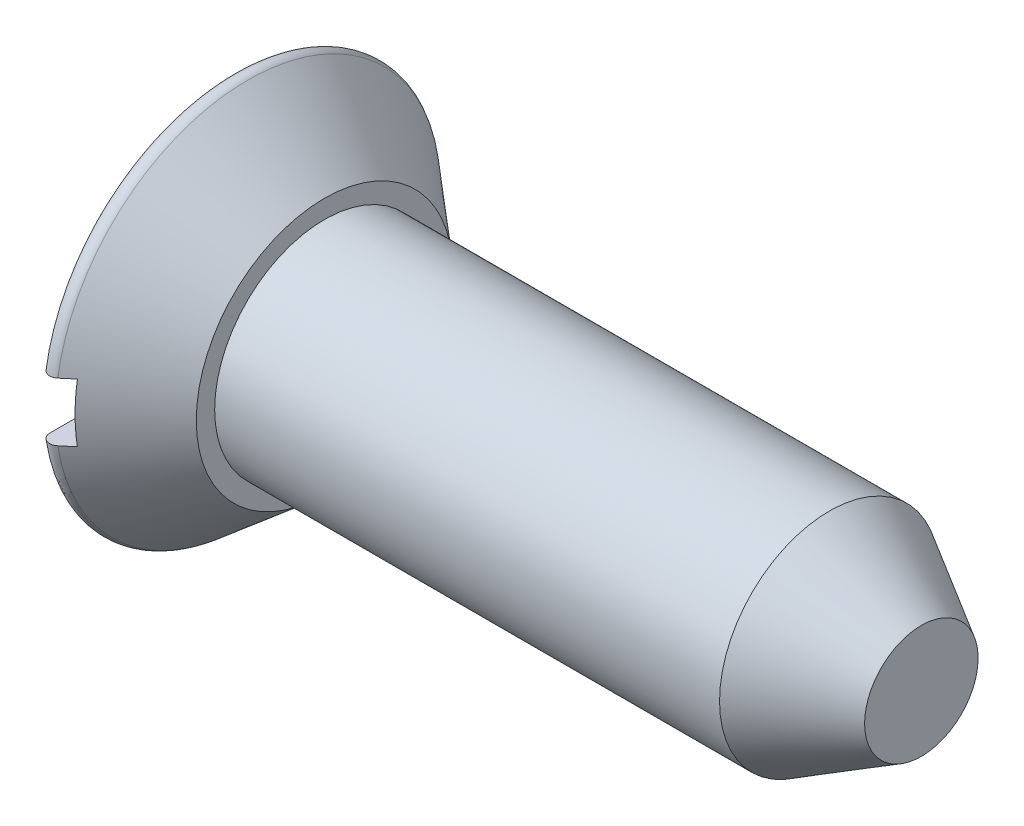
ISO-10303-21;
HEADER;
FILE_DESCRIPTION(('STEP AP214'),'2;1');
FILE_NAME('part.step','',(''),(''),'','','');
FILE_SCHEMA(('AUTOMOTIVE_DESIGN { 1 0 10303 214 1 1 1 1 }'));
ENDSEC;
DATA;
#1=APPLICATION_CONTEXT('core data for automotive mechanical design processes');
#2=APPLICATION_PROTOCOL_DEFINITION('international standard','automotive_design',2000,#1);
#3=PRODUCT_CONTEXT('',#1,'mechanical');
#4=PRODUCT('Part','Part','',(#3));
#5=PRODUCT_RELATED_PRODUCT_CATEGORY('part','',(#4));
#6=PRODUCT_DEFINITION_FORMATION('','',#4);
#7=PRODUCT_DEFINITION_CONTEXT('part definition',#1,'design');
#8=PRODUCT_DEFINITION('design','',#6,#7);
#9=PRODUCT_DEFINITION_SHAPE('','',#8);
#10=(LENGTH_UNIT() NAMED_UNIT(*) SI_UNIT(.MILLI.,.METRE.));
#11=(NAMED_UNIT(*) PLANE_ANGLE_UNIT() SI_UNIT($,.RADIAN.));
#12=(NAMED_UNIT(*) SI_UNIT($,.STERADIAN.) SOLID_ANGLE_UNIT());
#13=UNCERTAINTY_MEASURE_WITH_UNIT(LENGTH_MEASURE(1.E-05),#10,'distance_accuracy_value','');
#14=(GEOMETRIC_REPRESENTATION_CONTEXT(3) GLOBAL_UNCERTAINTY_ASSIGNED_CONTEXT((#13)) GLOBAL_UNIT_ASSIGNED_CONTEXT((#10,
#11,#12)) REPRESENTATION_CONTEXT('',''));
#15=CARTESIAN_POINT('',(0.,0.,0.));
#16=DIRECTION('',(0.,0.,1.));
#17=DIRECTION('',(1.,0.,0.));
#18=AXIS2_PLACEMENT_3D('',#15,#16,#17);
#19=CARTESIAN_POINT('',(0.,0.,0.));
#20=DIRECTION('',(-1.,0.,0.));
#21=DIRECTION('',(0.,0.,1.));
#22=AXIS2_PLACEMENT_3D('',#19,#20,#21);
#23=CYLINDRICAL_SURFACE('',#22,0.762);
#24=CARTESIAN_POINT('',(0.635,0.,0.));
#25=DIRECTION('',(-1.,0.,0.));
#26=DIRECTION('',(0.,0.,1.));
#27=AXIS2_PLACEMENT_3D('',#24,#25,#26);
#28=CIRCLE('',#27,0.762);
#29=CARTESIAN_POINT('',(0.635,0.,0.762));
#30=VERTEX_POINT('',#29);
#31=EDGE_CURVE('E198',#30,#30,#28,.T.);
#32=ORIENTED_EDGE('',*,*,#31,.F.);
#33=EDGE_LOOP('',(#32));
#34=FACE_BOUND('',#33,.T.);
#35=CARTESIAN_POINT('',(4.13728568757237,0.,0.));
#36=DIRECTION('',(-1.,0.,0.));
#37=DIRECTION('',(0.,0.,1.));
#38=AXIS2_PLACEMENT_3D('',#35,#36,#37);
#39=CIRCLE('',#38,0.762);
#40=CARTESIAN_POINT('',(4.13728568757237,0.,0.762));
#41=VERTEX_POINT('',#40);
#42=EDGE_CURVE('E261',#41,#41,#39,.T.);
#43=ORIENTED_EDGE('',*,*,#42,.T.);
#44=EDGE_LOOP('',(#43));
#45=FACE_BOUND('',#44,.T.);
#46=ADVANCED_FACE('F82',(#34,#45),#23,.T.);
#47=CARTESIAN_POINT('',(0.,0.,0.));
#48=DIRECTION('',(1.,0.,0.));
#49=DIRECTION('',(0.,0.,-1.));
#50=AXIS2_PLACEMENT_3D('',#47,#48,#49);
#51=PLANE('',#50);
#52=CARTESIAN_POINT('',(0.,0.,0.));
#53=DIRECTION('',(-1.,0.,0.));
#54=DIRECTION('',(0.,0.,1.));
#55=AXIS2_PLACEMENT_3D('',#52,#53,#54);
#56=CIRCLE('',#55,1.28622381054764);
#57=CARTESIAN_POINT('',(0.,0.2032,1.27007143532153));
#58=VERTEX_POINT('',#57);
#59=CARTESIAN_POINT('',(0.,0.2032,-1.27007143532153));
#60=VERTEX_POINT('',#59);
#61=EDGE_CURVE('E180',#58,#60,#56,.T.);
#62=ORIENTED_EDGE('',*,*,#61,.T.);
#63=DIRECTION('',(0.,0.,1.));
#64=VECTOR('',#63,1.);
#65=CARTESIAN_POINT('',(0.,0.2032,-1.34972381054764));
#66=LINE('',#65,#64);
#67=EDGE_CURVE('E237',#60,#58,#66,.T.);
#68=ORIENTED_EDGE('',*,*,#67,.T.);
#69=EDGE_LOOP('',(#62,#68));
#70=FACE_BOUND('',#69,.T.);
#71=ADVANCED_FACE('F276',(#70),#51,.F.);
#72=CARTESIAN_POINT('',(0.0635,0.,0.));
#73=DIRECTION('',(-1.,0.,0.));
#74=DIRECTION('',(0.,0.,1.));
#75=AXIS2_PLACEMENT_3D('',#72,#73,#74);
#76=TOROIDAL_SURFACE('',#75,1.28622381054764,0.0634999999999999);
#77=CARTESIAN_POINT('',(0.104317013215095,0.,0.));
#78=DIRECTION('',(-1.,0.,0.));
#79=DIRECTION('',(0.,0.,1.));
#80=AXIS2_PLACEMENT_3D('',#77,#78,#79);
#81=CIRCLE('',#80,1.3348676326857);
#82=CARTESIAN_POINT('',(0.104317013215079,0.2032,1.31931094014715));
#83=VERTEX_POINT('',#82);
#84=CARTESIAN_POINT('',(0.104317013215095,0.2032,-1.31931094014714));
#85=VERTEX_POINT('',#84);
#86=EDGE_CURVE('E191',#83,#85,#81,.T.);
#87=ORIENTED_EDGE('',*,*,#86,.T.);
#88=CARTESIAN_POINT('',(0.0245970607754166,0.2032,-1.32087306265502));
#89=CARTESIAN_POINT('',(0.0217621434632,0.2032,-1.3186495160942));
#90=CARTESIAN_POINT('',(0.0191144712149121,0.2032,-1.31618267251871));
#91=CARTESIAN_POINT('',(0.0142700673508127,0.2032,-1.31083617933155));
#92=CARTESIAN_POINT('',(0.0120739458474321,0.2032,-1.30795598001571));
#93=CARTESIAN_POINT('',(0.00819684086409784,0.2032,-1.30187126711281));
#94=CARTESIAN_POINT('',(0.00651536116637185,0.2032,-1.29866706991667));
#95=CARTESIAN_POINT('',(0.00370972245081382,0.2032,-1.29202456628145));
#96=CARTESIAN_POINT('',(0.00258542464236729,0.2032,-1.28858631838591));
#97=CARTESIAN_POINT('',(0.000915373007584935,0.2032,-1.28154210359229));
#98=CARTESIAN_POINT('',(0.000374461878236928,0.2032,-1.27793498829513));
#99=CARTESIAN_POINT('',(-9.85513835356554E-05,0.2032,-1.27068084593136));
#100=CARTESIAN_POINT('',(-3.05991733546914E-05,0.2032,-1.26703381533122));
#101=CARTESIAN_POINT('',(0.000714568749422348,0.2032,-1.25977791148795));
#102=CARTESIAN_POINT('',(0.00139583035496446,0.2032,-1.25616945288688));
#103=CARTESIAN_POINT('',(0.00335504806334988,0.2032,-1.24911821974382));
#104=CARTESIAN_POINT('',(0.0046330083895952,0.2032,-1.24567544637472));
#105=CARTESIAN_POINT('',(0.00774975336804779,0.2032,-1.23905821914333));
#106=CARTESIAN_POINT('',(0.00958793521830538,0.2032,-1.23588348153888));
#107=CARTESIAN_POINT('',(0.0137757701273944,0.2032,-1.2298913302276));
#108=CARTESIAN_POINT('',(0.0161254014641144,0.2032,-1.22707390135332));
#109=CARTESIAN_POINT('',(0.021247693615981,0.2032,-1.22190446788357));
#110=CARTESIAN_POINT('',(0.0240163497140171,0.2032,-1.21954849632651));
#111=CARTESIAN_POINT('',(0.0299143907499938,0.2032,-1.21534225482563));
#112=CARTESIAN_POINT('',(0.0330437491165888,0.2032,-1.21349194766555));
#113=CARTESIAN_POINT('',(0.0395299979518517,0.2032,-1.21037547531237));
#114=CARTESIAN_POINT('',(0.0428833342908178,0.2032,-1.20910191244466));
#115=CARTESIAN_POINT('',(0.0497576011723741,0.2032,-1.20714299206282));
#116=CARTESIAN_POINT('',(0.053278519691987,0.2032,-1.20645759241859));
#117=CARTESIAN_POINT('',(0.0603461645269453,0.2032,-1.20570077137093));
#118=CARTESIAN_POINT('',(0.0638921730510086,0.2032,-1.20562263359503));
#119=CARTESIAN_POINT('',(0.0709465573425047,0.2032,-1.20606504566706));
#120=CARTESIAN_POINT('',(0.0744549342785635,0.2032,-1.20658557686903));
#121=CARTESIAN_POINT('',(0.081322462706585,0.2032,-1.20820641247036));
#122=CARTESIAN_POINT('',(0.0846820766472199,0.2032,-1.20930475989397));
#123=CARTESIAN_POINT('',(0.0911708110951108,0.2032,-1.21204664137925));
#124=CARTESIAN_POINT('',(0.0942999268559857,0.2032,-1.21369018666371));
#125=CARTESIAN_POINT('',(0.100259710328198,0.2032,-1.21748487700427));
#126=CARTESIAN_POINT('',(0.103088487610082,0.2032,-1.21963898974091));
#127=CARTESIAN_POINT('',(0.108349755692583,0.2032,-1.2243862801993));
#128=CARTESIAN_POINT('',(0.110782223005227,0.2032,-1.22697948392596));
#129=CARTESIAN_POINT('',(0.115213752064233,0.2032,-1.23256496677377));
#130=CARTESIAN_POINT('',(0.117207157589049,0.2032,-1.23556173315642));
#131=CARTESIAN_POINT('',(0.120669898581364,0.2032,-1.24184409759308));
#132=CARTESIAN_POINT('',(0.12213919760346,0.2032,-1.24512971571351));
#133=CARTESIAN_POINT('',(0.124530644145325,0.2032,-1.2519409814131));
#134=CARTESIAN_POINT('',(0.125445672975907,0.2032,-1.25546912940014));
#135=CARTESIAN_POINT('',(0.126675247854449,0.2032,-1.26262860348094));
#136=CARTESIAN_POINT('',(0.126989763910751,0.2032,-1.26625993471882));
#137=CARTESIAN_POINT('',(0.127009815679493,0.2032,-1.27355096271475));
#138=CARTESIAN_POINT('',(0.126710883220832,0.2032,-1.27721067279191));
#139=CARTESIAN_POINT('',(0.125502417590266,0.2032,-1.28442794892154));
#140=CARTESIAN_POINT('',(0.124592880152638,0.2032,-1.28798551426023));
#141=CARTESIAN_POINT('',(0.122188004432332,0.2032,-1.29489360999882));
#142=CARTESIAN_POINT('',(0.120693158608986,0.2032,-1.29824431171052));
#143=CARTESIAN_POINT('',(0.117157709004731,0.2032,-1.30464435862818));
#144=CARTESIAN_POINT('',(0.115117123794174,0.2032,-1.30769371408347));
#145=CARTESIAN_POINT('',(0.110565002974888,0.2032,-1.31337735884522));
#146=CARTESIAN_POINT('',(0.108057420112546,0.2032,-1.31601481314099));
#147=CARTESIAN_POINT('',(0.102630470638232,0.2032,-1.3208252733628));
#148=CARTESIAN_POINT('',(0.0997111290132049,0.2032,-1.32299830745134));
#149=CARTESIAN_POINT('',(0.0935795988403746,0.2032,-1.32679163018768));
#150=CARTESIAN_POINT('',(0.0903711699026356,0.2032,-1.32841799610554));
#151=CARTESIAN_POINT('',(0.0837249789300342,0.2032,-1.33110261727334));
#152=CARTESIAN_POINT('',(0.0802872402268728,0.2032,-1.33216093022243));
#153=CARTESIAN_POINT('',(0.0733175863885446,0.2032,-1.3336692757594));
#154=CARTESIAN_POINT('',(0.0697869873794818,0.2032,-1.33412539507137));
#155=CARTESIAN_POINT('',(0.0626985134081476,0.2032,-1.33443538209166));
#156=CARTESIAN_POINT('',(0.0591406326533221,0.2032,-1.33428911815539));
#157=CARTESIAN_POINT('',(0.0521157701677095,0.2032,-1.33340064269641));
#158=CARTESIAN_POINT('',(0.0486484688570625,0.2032,-1.33266094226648));
#159=CARTESIAN_POINT('',(0.04188995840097,0.2032,-1.33061137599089));
#160=CARTESIAN_POINT('',(0.0385985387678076,0.2032,-1.32930220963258));
#161=CARTESIAN_POINT('',(0.0335237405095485,0.2032,-1.32677376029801));
#162=CARTESIAN_POINT('',(0.0316555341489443,0.2032,-1.32572089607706));
#163=CARTESIAN_POINT('',(0.0280351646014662,0.2032,-1.32343172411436));
#164=CARTESIAN_POINT('',(0.0262830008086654,0.2032,-1.32219541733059));
#165=CARTESIAN_POINT('',(0.0245970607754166,0.2032,-1.32087306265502));
#166=B_SPLINE_CURVE_WITH_KNOTS('',3,(#88,#89,#90,#91,#92,#93,#94,#95,#96,#97,#98,#99,#100,#101,
#102,#103,#104,#105,#106,#107,#108,#109,#110,#111,#112,#113,#114,#115,#116,#117,#118,#119,#120,
#121,#122,#123,#124,#125,#126,#127,#128,#129,#130,#131,#132,#133,#134,#135,#136,#137,#138,#139,
#140,#141,#142,#143,#144,#145,#146,#147,#148,#149,#150,#151,#152,#153,#154,#155,#156,#157,#158,
#159,#160,#161,#162,#163,#164,#165),.UNSPECIFIED.,.T.,.F.,(4,2,2,2,2,2,2,2,2,2,2,2,2,2,2,2,2,2,
2,2,2,2,2,2,2,2,2,2,2,2,2,2,2,2,2,2,2,2,4),(0.,0.0108007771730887,0.0216160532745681,
0.0324208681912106,0.0432229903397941,0.054114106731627,0.0650061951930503,0.0759706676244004,
0.0869352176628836,0.0978880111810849,0.108840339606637,0.11969392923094,0.130546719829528,
0.141256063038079,0.151964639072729,0.162554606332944,0.173144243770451,0.183698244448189,
0.194252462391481,0.204869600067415,0.215487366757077,0.226234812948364,0.236983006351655,
0.247866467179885,0.258750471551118,0.269714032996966,0.28067767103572,0.291632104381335,
0.302586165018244,0.313451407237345,0.324315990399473,0.335055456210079,0.345793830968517,
0.356422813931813,0.367054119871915,0.377640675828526,0.388214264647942,0.39463757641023,
0.401060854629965),.UNSPECIFIED.);
#167=EDGE_CURVE('E209',#85,#60,#166,.T.);
#168=ORIENTED_EDGE('',*,*,#167,.T.);
#169=ORIENTED_EDGE('',*,*,#61,.F.);
#170=CARTESIAN_POINT('',(0.0369446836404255,0.2032,1.2116220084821));
#171=CARTESIAN_POINT('',(0.033701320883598,0.2032,1.21313624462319));
#172=CARTESIAN_POINT('',(0.030584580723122,0.2032,1.21492831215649));
#173=CARTESIAN_POINT('',(0.0246950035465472,0.2032,1.21901363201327));
#174=CARTESIAN_POINT('',(0.0219226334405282,0.2032,1.22130755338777));
#175=CARTESIAN_POINT('',(0.0168036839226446,0.2032,1.22632468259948));
#176=CARTESIAN_POINT('',(0.0144566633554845,0.2032,1.22904744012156));
#177=CARTESIAN_POINT('',(0.0102484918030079,0.2032,1.23484418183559));
#178=CARTESIAN_POINT('',(0.00838722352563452,0.2032,1.23791808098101));
#179=CARTESIAN_POINT('',(0.00518252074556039,0.2032,1.24436256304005));
#180=CARTESIAN_POINT('',(0.00384433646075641,0.2032,1.24773575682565));
#181=CARTESIAN_POINT('',(0.00174695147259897,0.2032,1.25465776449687));
#182=CARTESIAN_POINT('',(0.000987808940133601,0.2032,1.25820659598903));
#183=CARTESIAN_POINT('',(6.40048051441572E-05,0.2032,1.26541627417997));
#184=CARTESIAN_POINT('',(-9.47599389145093E-05,0.2032,1.26907787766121));
#185=CARTESIAN_POINT('',(0.000203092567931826,0.2032,1.27637604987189));
#186=CARTESIAN_POINT('',(0.000659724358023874,0.2032,1.28001261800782));
#187=CARTESIAN_POINT('',(0.00217856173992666,0.2032,1.28716586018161));
#188=CARTESIAN_POINT('',(0.003242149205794,0.2032,1.29068224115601));
#189=CARTESIAN_POINT('',(0.00594791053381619,0.2032,1.2974849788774));
#190=CARTESIAN_POINT('',(0.00759007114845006,0.2032,1.30077134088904));
#191=CARTESIAN_POINT('',(0.0113975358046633,0.2032,1.3069998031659));
#192=CARTESIAN_POINT('',(0.013559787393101,0.2032,1.30994376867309));
#193=CARTESIAN_POINT('',(0.0183528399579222,0.2032,1.31542185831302));
#194=CARTESIAN_POINT('',(0.0209836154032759,0.2032,1.31795600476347));
#195=CARTESIAN_POINT('',(0.0266087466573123,0.2032,1.32251295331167));
#196=CARTESIAN_POINT('',(0.0295988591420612,0.2032,1.3245409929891));
#197=CARTESIAN_POINT('',(0.0358801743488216,0.2032,1.32805963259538));
#198=CARTESIAN_POINT('',(0.0391713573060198,0.2032,1.3295502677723));
#199=CARTESIAN_POINT('',(0.0459217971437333,0.2032,1.33193485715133));
#200=CARTESIAN_POINT('',(0.0493787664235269,0.2032,1.33283528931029));
#201=CARTESIAN_POINT('',(0.0563951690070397,0.2032,1.33403840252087));
#202=CARTESIAN_POINT('',(0.0599545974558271,0.2032,1.33434111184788));
#203=CARTESIAN_POINT('',(0.0670481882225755,0.2032,1.33433955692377));
#204=CARTESIAN_POINT('',(0.0705823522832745,0.2032,1.33403954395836));
#205=CARTESIAN_POINT('',(0.0775500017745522,0.2032,1.33285018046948));
#206=CARTESIAN_POINT('',(0.0809834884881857,0.2032,1.33196083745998));
#207=CARTESIAN_POINT('',(0.0876519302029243,0.2032,1.32961991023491));
#208=CARTESIAN_POINT('',(0.0908869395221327,0.2032,1.32816848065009));
#209=CARTESIAN_POINT('',(0.0970695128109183,0.2032,1.32474648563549));
#210=CARTESIAN_POINT('',(0.100017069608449,0.2032,1.32277590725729));
#211=CARTESIAN_POINT('',(0.105562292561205,0.2032,1.31835874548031));
#212=CARTESIAN_POINT('',(0.108157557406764,0.2032,1.31590914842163));
#213=CARTESIAN_POINT('',(0.112905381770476,0.2032,1.31061317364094));
#214=CARTESIAN_POINT('',(0.115057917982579,0.2032,1.30776677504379));
#215=CARTESIAN_POINT('',(0.1188842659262,0.2032,1.30172513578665));
#216=CARTESIAN_POINT('',(0.120552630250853,0.2032,1.2985264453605));
#217=CARTESIAN_POINT('',(0.123335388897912,0.2032,1.29189656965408));
#218=CARTESIAN_POINT('',(0.124449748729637,0.2032,1.28846536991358));
#219=CARTESIAN_POINT('',(0.126105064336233,0.2032,1.28142728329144));
#220=CARTESIAN_POINT('',(0.126639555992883,0.2032,1.27781887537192));
#221=CARTESIAN_POINT('',(0.127099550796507,0.2032,1.27056340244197));
#222=CARTESIAN_POINT('',(0.127025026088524,0.2032,1.266916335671));
#223=CARTESIAN_POINT('',(0.126266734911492,0.2032,1.25966157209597));
#224=CARTESIAN_POINT('',(0.125578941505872,0.2032,1.25605429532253));
#225=CARTESIAN_POINT('',(0.123606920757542,0.2032,1.24900650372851));
#226=CARTESIAN_POINT('',(0.122322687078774,0.2032,1.2455659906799));
#227=CARTESIAN_POINT('',(0.119193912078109,0.2032,1.23895449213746));
#228=CARTESIAN_POINT('',(0.117350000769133,0.2032,1.23578320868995));
#229=CARTESIAN_POINT('',(0.113151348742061,0.2032,1.22979889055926));
#230=CARTESIAN_POINT('',(0.110796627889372,0.2032,1.22698584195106));
#231=CARTESIAN_POINT('',(0.105665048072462,0.2032,1.22182599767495));
#232=CARTESIAN_POINT('',(0.10289219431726,0.2032,1.21947521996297));
#233=CARTESIAN_POINT('',(0.0969868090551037,0.2032,1.21528010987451));
#234=CARTESIAN_POINT('',(0.0938543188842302,0.2032,1.21343571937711));
#235=CARTESIAN_POINT('',(0.087363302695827,0.2032,1.21033160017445));
#236=CARTESIAN_POINT('',(0.084008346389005,0.2032,1.20906440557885));
#237=CARTESIAN_POINT('',(0.0771309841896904,0.2032,1.20711809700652));
#238=CARTESIAN_POINT('',(0.0736085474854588,0.2032,1.20643909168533));
#239=CARTESIAN_POINT('',(0.0665375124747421,0.2032,1.20569486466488));
#240=CARTESIAN_POINT('',(0.0629895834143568,0.2032,1.20562323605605));
#241=CARTESIAN_POINT('',(0.0559355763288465,0.2032,1.20607947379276));
#242=CARTESIAN_POINT('',(0.0524294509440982,0.2032,1.20660658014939));
#243=CARTESIAN_POINT('',(0.0469218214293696,0.2032,1.20791670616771));
#244=CARTESIAN_POINT('',(0.0448746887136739,0.2032,1.20851552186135));
#245=CARTESIAN_POINT('',(0.0408516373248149,0.2032,1.20991740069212));
#246=CARTESIAN_POINT('',(0.0388757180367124,0.2032,1.21072046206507));
#247=CARTESIAN_POINT('',(0.0369446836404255,0.2032,1.2116220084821));
#248=B_SPLINE_CURVE_WITH_KNOTS('',3,(#170,#171,#172,#173,#174,#175,#176,#177,#178,#179,#180,
#181,#182,#183,#184,#185,#186,#187,#188,#189,#190,#191,#192,#193,#194,#195,#196,#197,#198,#199,
#200,#201,#202,#203,#204,#205,#206,#207,#208,#209,#210,#211,#212,#213,#214,#215,#216,#217,#218,
#219,#220,#221,#222,#223,#224,#225,#226,#227,#228,#229,#230,#231,#232,#233,#234,#235,#236,#237,
#238,#239,#240,#241,#242,#243,#244,#245,#246,#247),.UNSPECIFIED.,.T.,.F.,(4,2,2,2,2,2,2,2,2,2,2,
2,2,2,2,2,2,2,2,2,2,2,2,2,2,2,2,2,2,2,2,2,2,2,2,2,2,2,4),(0.,0.0107303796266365,
0.0214751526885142,0.0322087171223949,0.0429396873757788,0.0537757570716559,0.0646129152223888,
0.0755562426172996,0.0864998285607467,0.0974684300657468,0.108436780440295,0.119342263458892,
0.130247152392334,0.141034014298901,0.151820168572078,0.162485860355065,0.173151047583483,
0.183741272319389,0.194331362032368,0.204918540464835,0.215505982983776,0.226162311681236,
0.236819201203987,0.247591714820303,0.258364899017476,0.269256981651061,0.280149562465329,
0.291114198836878,0.302078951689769,0.313031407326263,0.323983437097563,0.334836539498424,
0.345688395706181,0.356395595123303,0.36710477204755,0.377700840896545,0.388283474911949,
0.394672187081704,0.401060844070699),.UNSPECIFIED.);
#249=EDGE_CURVE('E203',#58,#83,#248,.T.);
#250=ORIENTED_EDGE('',*,*,#249,.T.);
#251=EDGE_LOOP('',(#87,#168,#169,#250));
#252=FACE_BOUND('',#251,.T.);
#253=ADVANCED_FACE('F255',(#252),#76,.T.);
#254=CARTESIAN_POINT('',(0.,-0.2032,-1.27007143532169));
#255=VERTEX_POINT('',#254);
#256=CARTESIAN_POINT('',(0.,-0.2032,1.27007143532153));
#257=VERTEX_POINT('',#256);
#258=EDGE_CURVE('E182',#255,#257,#56,.T.);
#259=ORIENTED_EDGE('',*,*,#258,.T.);
#260=DIRECTION('',(0.,0.,1.));
#261=VECTOR('',#260,1.);
#262=CARTESIAN_POINT('',(0.,-0.2032,-1.34972381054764));
#263=LINE('',#262,#261);
#264=EDGE_CURVE('E158',#255,#257,#263,.T.);
#265=ORIENTED_EDGE('',*,*,#264,.F.);
#266=EDGE_LOOP('',(#259,#265));
#267=FACE_BOUND('',#266,.T.);
#268=ADVANCED_FACE('F83',(#267),#51,.F.);
#269=ORIENTED_EDGE('',*,*,#258,.F.);
#270=CARTESIAN_POINT('',(0.0245970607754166,-0.2032,-1.32087306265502));
#271=CARTESIAN_POINT('',(0.0273876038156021,-0.2032,-1.32306140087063));
#272=CARTESIAN_POINT('',(0.0303635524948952,-0.2032,-1.32501721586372));
#273=CARTESIAN_POINT('',(0.0366035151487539,-0.2032,-1.32840390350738));
#274=CARTESIAN_POINT('',(0.0398678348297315,-0.2032,-1.32983421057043));
#275=CARTESIAN_POINT('',(0.0465905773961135,-0.2032,-1.33212487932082));
#276=CARTESIAN_POINT('',(0.0500489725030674,-0.2032,-1.33298532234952));
#277=CARTESIAN_POINT('',(0.057060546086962,-0.2032,-1.33410999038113));
#278=CARTESIAN_POINT('',(0.0606137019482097,-0.2032,-1.33437435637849));
#279=CARTESIAN_POINT('',(0.0676972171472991,-0.2032,-1.3342994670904));
#280=CARTESIAN_POINT('',(0.0712276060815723,-0.2032,-1.33396298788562));
#281=CARTESIAN_POINT('',(0.0781817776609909,-0.2032,-1.33270196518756));
#282=CARTESIAN_POINT('',(0.0816055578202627,-0.2032,-1.33177740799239));
#283=CARTESIAN_POINT('',(0.088249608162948,-0.2032,-1.32936810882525));
#284=CARTESIAN_POINT('',(0.0914698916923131,-0.2032,-1.32788340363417));
#285=CARTESIAN_POINT('',(0.0976177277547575,-0.2032,-1.32439787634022));
#286=CARTESIAN_POINT('',(0.100545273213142,-0.2032,-1.32239704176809));
#287=CARTESIAN_POINT('',(0.106046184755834,-0.2032,-1.31792262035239));
#288=CARTESIAN_POINT('',(0.108617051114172,-0.2032,-1.3154459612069));
#289=CARTESIAN_POINT('',(0.113311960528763,-0.2032,-1.3101003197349));
#290=CARTESIAN_POINT('',(0.115435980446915,-0.2032,-1.30723131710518));
#291=CARTESIAN_POINT('',(0.119201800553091,-0.2032,-1.3011490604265));
#292=CARTESIAN_POINT('',(0.120838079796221,-0.2032,-1.29793238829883));
#293=CARTESIAN_POINT('',(0.123554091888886,-0.2032,-1.29127210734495));
#294=CARTESIAN_POINT('',(0.124633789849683,-0.2032,-1.28782848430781));
#295=CARTESIAN_POINT('',(0.126217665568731,-0.2032,-1.28077157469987));
#296=CARTESIAN_POINT('',(0.126715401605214,-0.2032,-1.27715684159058));
#297=CARTESIAN_POINT('',(0.127101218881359,-0.2032,-1.26989493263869));
#298=CARTESIAN_POINT('',(0.126989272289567,-0.2032,-1.26624775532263));
#299=CARTESIAN_POINT('',(0.126156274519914,-0.2032,-1.25899978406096));
#300=CARTESIAN_POINT('',(0.125431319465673,-0.2032,-1.25539943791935));
#301=CARTESIAN_POINT('',(0.123386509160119,-0.2032,-1.24837172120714));
#302=CARTESIAN_POINT('',(0.12206664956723,-0.2032,-1.24494435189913));
#303=CARTESIAN_POINT('',(0.118869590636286,-0.2032,-1.23836591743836));
#304=CARTESIAN_POINT('',(0.116993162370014,-0.2032,-1.23521447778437));
#305=CARTESIAN_POINT('',(0.11273320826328,-0.2032,-1.2292751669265));
#306=CARTESIAN_POINT('',(0.110349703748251,-0.2032,-1.22648728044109));
#307=CARTESIAN_POINT('',(0.105165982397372,-0.2032,-1.22138274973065));
#308=CARTESIAN_POINT('',(0.102369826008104,-0.2032,-1.21906198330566));
#309=CARTESIAN_POINT('',(0.0964231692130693,-0.2032,-1.21493035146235));
#310=CARTESIAN_POINT('',(0.0932726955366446,-0.2032,-1.21311944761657));
#311=CARTESIAN_POINT('',(0.0867516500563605,-0.2032,-1.21008431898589));
#312=CARTESIAN_POINT('',(0.0833845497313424,-0.2032,-1.20885263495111));
#313=CARTESIAN_POINT('',(0.0764900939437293,-0.2032,-1.20697907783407));
#314=CARTESIAN_POINT('',(0.0729627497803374,-0.2032,-1.20633716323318));
#315=CARTESIAN_POINT('',(0.0658890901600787,-0.2032,-1.20566699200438));
#316=CARTESIAN_POINT('',(0.0623433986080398,-0.2032,-1.2056321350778));
#317=CARTESIAN_POINT('',(0.0552969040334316,-0.2032,-1.20616022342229));
#318=CARTESIAN_POINT('',(0.0517960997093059,-0.2032,-1.20672315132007));
#319=CARTESIAN_POINT('',(0.0449494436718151,-0.2032,-1.20842675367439));
#320=CARTESIAN_POINT('',(0.0416031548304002,-0.2032,-1.20956567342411));
#321=CARTESIAN_POINT('',(0.0351475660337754,-0.2032,-1.21238573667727));
#322=CARTESIAN_POINT('',(0.032038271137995,-0.2032,-1.21406689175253));
#323=CARTESIAN_POINT('',(0.0261231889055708,-0.2032,-1.21793359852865));
#324=CARTESIAN_POINT('',(0.0233194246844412,-0.2032,-1.22012224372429));
#325=CARTESIAN_POINT('',(0.0181134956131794,-0.2032,-1.2249339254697));
#326=CARTESIAN_POINT('',(0.0157113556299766,-0.2032,-1.22755698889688));
#327=CARTESIAN_POINT('',(0.0113450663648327,-0.2032,-1.23319742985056));
#328=CARTESIAN_POINT('',(0.00938668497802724,-0.2032,-1.23621927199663));
#329=CARTESIAN_POINT('',(0.00599771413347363,-0.2032,-1.24254567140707));
#330=CARTESIAN_POINT('',(0.00456716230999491,-0.2032,-1.2458502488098));
#331=CARTESIAN_POINT('',(0.00225653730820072,-0.2032,-1.25269272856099));
#332=CARTESIAN_POINT('',(0.0013835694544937,-0.2032,-1.25623303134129));
#333=CARTESIAN_POINT('',(0.000239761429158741,-0.2032,-1.26340952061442));
#334=CARTESIAN_POINT('',(-3.10726790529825E-05,-0.2032,-1.26704570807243));
#335=CARTESIAN_POINT('',(3.6978338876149E-05,-0.2032,-1.27433773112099));
#336=CARTESIAN_POINT('',(0.000380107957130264,-0.2032,-1.27799352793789));
#337=CARTESIAN_POINT('',(0.00167603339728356,-0.2032,-1.28519653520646));
#338=CARTESIAN_POINT('',(0.00262898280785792,-0.2032,-1.28874371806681));
#339=CARTESIAN_POINT('',(0.00511854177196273,-0.2032,-1.2956241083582));
#340=CARTESIAN_POINT('',(0.00665476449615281,-0.2032,-1.29895745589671));
#341=CARTESIAN_POINT('',(0.0102687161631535,-0.2032,-1.30531286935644));
#342=CARTESIAN_POINT('',(0.0123457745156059,-0.2032,-1.3083353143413));
#343=CARTESIAN_POINT('',(0.0161360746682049,-0.2032,-1.31295107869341));
#344=CARTESIAN_POINT('',(0.0177062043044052,-0.2032,-1.31466390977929));
#345=CARTESIAN_POINT('',(0.0210234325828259,-0.2032,-1.31790872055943));
#346=CARTESIAN_POINT('',(0.0227705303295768,-0.2032,-1.31944070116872));
#347=CARTESIAN_POINT('',(0.0245970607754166,-0.2032,-1.32087306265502));
#348=B_SPLINE_CURVE_WITH_KNOTS('',3,(#270,#271,#272,#273,#274,#275,#276,#277,#278,#279,#280,
#281,#282,#283,#284,#285,#286,#287,#288,#289,#290,#291,#292,#293,#294,#295,#296,#297,#298,#299,
#300,#301,#302,#303,#304,#305,#306,#307,#308,#309,#310,#311,#312,#313,#314,#315,#316,#317,#318,
#319,#320,#321,#322,#323,#324,#325,#326,#327,#328,#329,#330,#331,#332,#333,#334,#335,#336,#337,
#338,#339,#340,#341,#342,#343,#344,#345,#346,#347),.UNSPECIFIED.,.T.,.F.,(4,2,2,2,2,2,2,2,2,2,2,
2,2,2,2,2,2,2,2,2,2,2,2,2,2,2,2,2,2,2,2,2,2,2,2,2,2,2,4),(0.,0.0106304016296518,
0.0212722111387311,0.0319125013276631,0.042550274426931,0.0531390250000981,0.0637280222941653,
0.0743163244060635,0.0849048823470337,0.0955642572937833,0.106224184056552,0.117000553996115,
0.127777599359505,0.13867283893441,0.149568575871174,0.160534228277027,0.171499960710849,
0.182450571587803,0.193400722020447,0.204249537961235,0.215097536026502,0.225801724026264,
0.236505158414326,0.247092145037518,0.257678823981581,0.268233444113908,0.27878828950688,
0.289409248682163,0.300030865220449,0.310783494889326,0.321536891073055,0.332424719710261,
0.343312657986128,0.354276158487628,0.365242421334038,0.376201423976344,0.387146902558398,
0.394104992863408,0.401063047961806),.UNSPECIFIED.);
#349=CARTESIAN_POINT('',(0.104317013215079,-0.2032,-1.31931094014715));
#350=VERTEX_POINT('',#349);
#351=EDGE_CURVE('E238',#255,#350,#348,.T.);
#352=ORIENTED_EDGE('',*,*,#351,.T.);
#353=CARTESIAN_POINT('',(0.104317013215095,-0.2032,1.31931094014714));
#354=VERTEX_POINT('',#353);
#355=EDGE_CURVE('E165',#350,#354,#81,.T.);
#356=ORIENTED_EDGE('',*,*,#355,.T.);
#357=CARTESIAN_POINT('',(0.0369446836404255,-0.2032,1.2116220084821));
#358=CARTESIAN_POINT('',(0.0401391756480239,-0.2032,1.21013094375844));
#359=CARTESIAN_POINT('',(0.0434610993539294,-0.2032,1.20890719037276));
#360=CARTESIAN_POINT('',(0.0502657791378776,-0.2032,1.20703351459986));
#361=CARTESIAN_POINT('',(0.053748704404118,-0.2032,1.20638421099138));
#362=CARTESIAN_POINT('',(0.0607735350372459,-0.2032,1.20568103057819));
#363=CARTESIAN_POINT('',(0.0643154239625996,-0.2032,1.20562699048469));
#364=CARTESIAN_POINT('',(0.0713568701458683,-0.2032,1.20611575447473));
#365=CARTESIAN_POINT('',(0.0748564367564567,-0.2032,1.20665842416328));
#366=CARTESIAN_POINT('',(0.0817083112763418,-0.2032,1.20832199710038));
#367=CARTESIAN_POINT('',(0.0850608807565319,-0.2032,1.20944182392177));
#368=CARTESIAN_POINT('',(0.0915321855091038,-0.2032,1.21222513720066));
#369=CARTESIAN_POINT('',(0.094650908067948,-0.2032,1.21388865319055));
#370=CARTESIAN_POINT('',(0.10058716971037,-0.2032,1.21772157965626));
#371=CARTESIAN_POINT('',(0.103402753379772,-0.2032,1.21989401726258));
#372=CARTESIAN_POINT('',(0.108634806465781,-0.2032,1.22467548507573));
#373=CARTESIAN_POINT('',(0.111051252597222,-0.2032,1.22728454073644));
#374=CARTESIAN_POINT('',(0.115448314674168,-0.2032,1.23289922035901));
#375=CARTESIAN_POINT('',(0.117423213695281,-0.2032,1.23590932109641));
#376=CARTESIAN_POINT('',(0.120846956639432,-0.2032,1.24221511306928));
#377=CARTESIAN_POINT('',(0.122295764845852,-0.2032,1.24551082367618));
#378=CARTESIAN_POINT('',(0.124644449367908,-0.2032,1.25233870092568));
#379=CARTESIAN_POINT('',(0.12553721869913,-0.2032,1.25587331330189));
#380=CARTESIAN_POINT('',(0.126721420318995,-0.2032,1.26304192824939));
#381=CARTESIAN_POINT('',(0.127012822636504,-0.2032,1.26667593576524));
#382=CARTESIAN_POINT('',(0.126986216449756,-0.2032,1.27396791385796));
#383=CARTESIAN_POINT('',(0.126663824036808,-0.2032,1.27762586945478));
#384=CARTESIAN_POINT('',(0.125408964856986,-0.2032,1.28483569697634));
#385=CARTESIAN_POINT('',(0.124476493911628,-0.2032,1.28838756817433));
#386=CARTESIAN_POINT('',(0.122027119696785,-0.2032,1.29527989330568));
#387=CARTESIAN_POINT('',(0.120510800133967,-0.2032,1.29862055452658));
#388=CARTESIAN_POINT('',(0.116934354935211,-0.2032,1.30499698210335));
#389=CARTESIAN_POINT('',(0.114874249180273,-0.2032,1.30803275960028));
#390=CARTESIAN_POINT('',(0.110286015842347,-0.2032,1.31368588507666));
#391=CARTESIAN_POINT('',(0.107761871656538,-0.2032,1.31630646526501));
#392=CARTESIAN_POINT('',(0.102304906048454,-0.2032,1.32108059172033));
#393=CARTESIAN_POINT('',(0.0993721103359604,-0.2032,1.32323416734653));
#394=CARTESIAN_POINT('',(0.0932174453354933,-0.2032,1.32698672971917));
#395=CARTESIAN_POINT('',(0.0899993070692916,-0.2032,1.32859183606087));
#396=CARTESIAN_POINT('',(0.083337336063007,-0.2032,1.33123271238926));
#397=CARTESIAN_POINT('',(0.0798935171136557,-0.2032,1.33226851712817));
#398=CARTESIAN_POINT('',(0.0729150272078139,-0.2032,1.3337315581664));
#399=CARTESIAN_POINT('',(0.0693816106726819,-0.2032,1.33416478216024));
#400=CARTESIAN_POINT('',(0.0622923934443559,-0.2032,1.33442885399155));
#401=CARTESIAN_POINT('',(0.0587365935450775,-0.2032,1.3342597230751));
#402=CARTESIAN_POINT('',(0.0517206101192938,-0.2032,1.33332643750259));
#403=CARTESIAN_POINT('',(0.0482600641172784,-0.2032,1.33256500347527));
#404=CARTESIAN_POINT('',(0.0415154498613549,-0.2032,1.33047336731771));
#405=CARTESIAN_POINT('',(0.0382313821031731,-0.2032,1.32914316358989));
#406=CARTESIAN_POINT('',(0.0319233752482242,-0.2032,1.32594953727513));
#407=CARTESIAN_POINT('',(0.0289001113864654,-0.2032,1.3240847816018));
#408=CARTESIAN_POINT('',(0.0232061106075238,-0.2032,1.31987824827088));
#409=CARTESIAN_POINT('',(0.0205353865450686,-0.2032,1.31753645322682));
#410=CARTESIAN_POINT('',(0.0155971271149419,-0.2032,1.31242134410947));
#411=CARTESIAN_POINT('',(0.0133332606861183,-0.2032,1.3096444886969));
#412=CARTESIAN_POINT('',(0.00929757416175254,-0.2032,1.30375374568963));
#413=CARTESIAN_POINT('',(0.00752578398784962,-0.2032,1.30063983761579));
#414=CARTESIAN_POINT('',(0.00450308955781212,-0.2032,1.29412516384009));
#415=CARTESIAN_POINT('',(0.00325839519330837,-0.2032,1.29072151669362));
#416=CARTESIAN_POINT('',(0.00135182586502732,-0.2032,1.28375471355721));
#417=CARTESIAN_POINT('',(0.000689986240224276,-0.2032,1.28019154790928));
#418=CARTESIAN_POINT('',(-3.76868073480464E-05,-0.2032,1.27296932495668));
#419=CARTESIAN_POINT('',(-9.75863666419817E-05,-0.2032,1.2693096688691));
#420=CARTESIAN_POINT('',(0.000395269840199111,-0.2032,1.26203190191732));
#421=CARTESIAN_POINT('',(0.00094802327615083,-0.2032,1.25841379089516));
#422=CARTESIAN_POINT('',(0.00265460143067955,-0.2032,1.25130772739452));
#423=CARTESIAN_POINT('',(0.00381067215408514,-0.2032,1.24782031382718));
#424=CARTESIAN_POINT('',(0.00669476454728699,-0.2032,1.24108934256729));
#425=CARTESIAN_POINT('',(0.00842292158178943,-0.2032,1.23784584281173));
#426=CARTESIAN_POINT('',(0.0123960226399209,-0.2032,1.23171092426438));
#427=CARTESIAN_POINT('',(0.0146389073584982,-0.2032,1.22881817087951));
#428=CARTESIAN_POINT('',(0.0195820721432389,-0.2032,1.22345851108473));
#429=CARTESIAN_POINT('',(0.0222817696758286,-0.2032,1.22099107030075));
#430=CARTESIAN_POINT('',(0.0269956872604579,-0.2032,1.21737253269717));
#431=CARTESIAN_POINT('',(0.0288965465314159,-0.2032,1.21607117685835));
#432=CARTESIAN_POINT('',(0.0328283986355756,-0.2032,1.21368258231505));
#433=CARTESIAN_POINT('',(0.0348593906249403,-0.2032,1.21259534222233));
#434=CARTESIAN_POINT('',(0.0369446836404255,-0.2032,1.2116220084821));
#435=B_SPLINE_CURVE_WITH_KNOTS('',3,(#357,#358,#359,#360,#361,#362,#363,#364,#365,#366,#367,
#368,#369,#370,#371,#372,#373,#374,#375,#376,#377,#378,#379,#380,#381,#382,#383,#384,#385,#386,
#387,#388,#389,#390,#391,#392,#393,#394,#395,#396,#397,#398,#399,#400,#401,#402,#403,#404,#405,
#406,#407,#408,#409,#410,#411,#412,#413,#414,#415,#416,#417,#418,#419,#420,#421,#422,#423,#424,
#425,#426,#427,#428,#429,#430,#431,#432,#433,#434),.UNSPECIFIED.,.T.,.F.,(4,2,2,2,2,2,2,2,2,2,2,
2,2,2,2,2,2,2,2,2,2,2,2,2,2,2,2,2,2,2,2,2,2,2,2,2,2,2,4),(0.,0.0105677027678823,
0.0211467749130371,0.0317229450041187,0.0422967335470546,0.0528508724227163,0.0634055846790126,
0.074024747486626,0.0846445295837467,0.0953947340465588,0.106145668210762,0.117031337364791,
0.127917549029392,0.138881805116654,0.149846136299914,0.16079953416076,0.171752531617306,
0.182615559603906,0.193477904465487,0.204214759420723,0.214950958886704,0.225579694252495,
0.236208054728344,0.246787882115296,0.257367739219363,0.267974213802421,0.278581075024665,
0.289279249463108,0.299978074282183,0.310799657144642,0.32162189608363,0.332550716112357,
0.343479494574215,0.354449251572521,0.365421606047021,0.376350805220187,0.387266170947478,
0.394164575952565,0.401062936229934),.UNSPECIFIED.);
#436=EDGE_CURVE('E102',#354,#257,#435,.T.);
#437=ORIENTED_EDGE('',*,*,#436,.T.);
#438=EDGE_LOOP('',(#269,#352,#356,#437));
#439=FACE_BOUND('',#438,.T.);
#440=ADVANCED_FACE('F213',(#439),#76,.T.);
#441=CARTESIAN_POINT('',(0.635,0.,0.));
#442=DIRECTION('',(-1.,0.,0.));
#443=DIRECTION('',(0.,0.,1.));
#444=AXIS2_PLACEMENT_3D('',#441,#442,#443);
#445=CONICAL_SURFACE('',#444,0.889571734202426,0.698131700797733);
#446=CARTESIAN_POINT('',(0.1778,0.,0.));
#447=DIRECTION('',(1.,0.,0.));
#448=DIRECTION('',(0.,0.,-1.));
#449=AXIS2_PLACEMENT_3D('',#446,#447,#448);
#450=CIRCLE('',#449,1.27320808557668);
#451=CARTESIAN_POINT('',(0.1778,-0.2032,-1.25688845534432));
#452=VERTEX_POINT('',#451);
#453=CARTESIAN_POINT('',(0.1778,0.2032,-1.25688845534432));
#454=VERTEX_POINT('',#453);
#455=EDGE_CURVE('E96',#452,#454,#450,.T.);
#456=ORIENTED_EDGE('',*,*,#455,.T.);
#457=CARTESIAN_POINT('',(-1.49833080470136,0.2032,2.6719333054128));
#458=CARTESIAN_POINT('',(-1.39399185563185,0.2032,2.584128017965));
#459=CARTESIAN_POINT('',(-1.28966357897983,0.2032,2.49631003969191));
#460=CARTESIAN_POINT('',(-1.08103978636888,0.2032,2.32063292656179));
#461=CARTESIAN_POINT('',(-0.976744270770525,0.2032,2.23277379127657));
#462=CARTESIAN_POINT('',(-0.768153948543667,0.2032,2.05696194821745));
#463=CARTESIAN_POINT('',(-0.663859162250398,0.2032,1.96900921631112));
#464=CARTESIAN_POINT('',(-0.455339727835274,0.2032,1.79302279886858));
#465=CARTESIAN_POINT('',(-0.351115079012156,0.2032,1.70498911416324));
#466=CARTESIAN_POINT('',(-0.143489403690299,0.2032,1.52940130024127));
#467=CARTESIAN_POINT('',(-0.0400876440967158,0.2032,1.44184803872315));
#468=CARTESIAN_POINT('',(0.166538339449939,0.2032,1.26652616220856));
#469=CARTESIAN_POINT('',(0.269762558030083,0.2032,1.17875754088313));
#470=CARTESIAN_POINT('',(0.475854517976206,0.2032,1.00286548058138));
#471=CARTESIAN_POINT('',(0.578722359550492,0.2032,0.914742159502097));
#472=CARTESIAN_POINT('',(0.732448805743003,0.2032,0.781895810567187));
#473=CARTESIAN_POINT('',(0.78359384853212,0.2032,0.73750453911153));
#474=CARTESIAN_POINT('',(0.88555887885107,0.2032,0.648350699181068));
#475=CARTESIAN_POINT('',(0.936378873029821,0.2032,0.603588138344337));
#476=CARTESIAN_POINT('',(1.01482695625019,0.2032,0.533536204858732));
#477=CARTESIAN_POINT('',(1.0426680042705,0.2032,0.508485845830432));
#478=CARTESIAN_POINT('',(1.09806947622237,0.2032,0.458058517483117));
#479=CARTESIAN_POINT('',(1.12562980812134,0.2032,0.432681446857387));
#480=CARTESIAN_POINT('',(1.18041371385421,0.2032,0.381305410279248));
#481=CARTESIAN_POINT('',(1.20763508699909,0.2032,0.355304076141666));
#482=CARTESIAN_POINT('',(1.26121831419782,0.2032,0.302461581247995));
#483=CARTESIAN_POINT('',(1.28758073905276,0.2032,0.275621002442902));
#484=CARTESIAN_POINT('',(1.33419573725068,0.2032,0.225079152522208));
#485=CARTESIAN_POINT('',(1.35471713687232,0.2032,0.201636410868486));
#486=CARTESIAN_POINT('',(1.38344357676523,0.2032,0.164928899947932));
#487=CARTESIAN_POINT('',(1.39265798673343,0.2032,0.152465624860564));
#488=CARTESIAN_POINT('',(1.40998293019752,0.2032,0.126804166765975));
#489=CARTESIAN_POINT('',(1.41809556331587,0.2032,0.113607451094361));
#490=CARTESIAN_POINT('',(1.43098755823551,0.2032,0.0890865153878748));
#491=CARTESIAN_POINT('',(1.4361092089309,0.2032,0.0779471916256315));
#492=CARTESIAN_POINT('',(1.44459675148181,0.2032,0.0550242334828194));
#493=CARTESIAN_POINT('',(1.44796854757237,0.2032,0.0432429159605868));
#494=CARTESIAN_POINT('',(1.45192080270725,0.2032,0.0214044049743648));
#495=CARTESIAN_POINT('',(1.45289619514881,0.2032,0.0114213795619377));
#496=CARTESIAN_POINT('',(1.45306373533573,0.2032,-0.00855700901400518));
#497=CARTESIAN_POINT('',(1.45225647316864,0.2032,-0.0185523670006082));
#498=CARTESIAN_POINT('',(1.44859947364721,0.2032,-0.0407241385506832));
#499=CARTESIAN_POINT('',(1.44529013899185,0.2032,-0.0528220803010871));
#500=CARTESIAN_POINT('',(1.43680352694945,0.2032,-0.0763558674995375));
#501=CARTESIAN_POINT('',(1.43161861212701,0.2032,-0.0877887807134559));
#502=CARTESIAN_POINT('',(1.4174928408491,0.2032,-0.114884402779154));
#503=CARTESIAN_POINT('',(1.40790265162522,0.2032,-0.13019856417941));
#504=CARTESIAN_POINT('',(1.38734324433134,0.2032,-0.159887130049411));
#505=CARTESIAN_POINT('',(1.37637026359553,0.2032,-0.174258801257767));
#506=CARTESIAN_POINT('',(1.35353153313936,0.2032,-0.202451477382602));
#507=CARTESIAN_POINT('',(1.34165954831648,0.2032,-0.21626737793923));
#508=CARTESIAN_POINT('',(1.31741716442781,0.2032,-0.243413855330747));
#509=CARTESIAN_POINT('',(1.30504749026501,0.2032,-0.256745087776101));
#510=CARTESIAN_POINT('',(1.26301648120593,0.2032,-0.300907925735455));
#511=CARTESIAN_POINT('',(1.23260055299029,0.2032,-0.331016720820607));
#512=CARTESIAN_POINT('',(1.17093903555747,0.2032,-0.390376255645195));
#513=CARTESIAN_POINT('',(1.13969311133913,0.2032,-0.419626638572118));
#514=CARTESIAN_POINT('',(1.07669130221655,0.2032,-0.47766282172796));
#515=CARTESIAN_POINT('',(1.04493476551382,0.2032,-0.506447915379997));
#516=CARTESIAN_POINT('',(0.981146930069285,0.2032,-0.56369826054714));
#517=CARTESIAN_POINT('',(0.949115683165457,0.2032,-0.592163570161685));
#518=CARTESIAN_POINT('',(0.853158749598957,0.2032,-0.676894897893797));
#519=CARTESIAN_POINT('',(0.788967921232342,0.2032,-0.732860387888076));
#520=CARTESIAN_POINT('',(0.660286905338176,0.2032,-0.844353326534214));
#521=CARTESIAN_POINT('',(0.5957969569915,0.2032,-0.899881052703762));
#522=CARTESIAN_POINT('',(0.447511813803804,0.2032,-1.02709346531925));
#523=CARTESIAN_POINT('',(0.363648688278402,0.2032,-1.09869897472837));
#524=CARTESIAN_POINT('',(0.195739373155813,0.2032,-1.24169590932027));
#525=CARTESIAN_POINT('',(0.11169318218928,0.2032,-1.31308733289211));
#526=CARTESIAN_POINT('',(-0.140661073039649,0.2032,-1.52711183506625));
#527=CARTESIAN_POINT('',(-0.309133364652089,0.2032,-1.66955123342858));
#528=CARTESIAN_POINT('',(-0.647692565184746,0.2032,-1.95541110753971));
#529=CARTESIAN_POINT('',(-0.81778107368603,0.2032,-2.09882968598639));
#530=CARTESIAN_POINT('',(-1.15801706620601,0.2032,-2.38548405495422));
#531=CARTESIAN_POINT('',(-1.32816451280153,0.2032,-2.52871988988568));
#532=CARTESIAN_POINT('',(-1.49833080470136,0.2032,-2.6719333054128));
#533=B_SPLINE_CURVE_WITH_KNOTS('',3,(#457,#458,#459,#460,#461,#462,#463,#464,#465,#466,#467,
#468,#469,#470,#471,#472,#473,#474,#475,#476,#477,#478,#479,#480,#481,#482,#483,#484,#485,#486,
#487,#488,#489,#490,#491,#492,#493,#494,#495,#496,#497,#498,#499,#500,#501,#502,#503,#504,#505,
#506,#507,#508,#509,#510,#511,#512,#513,#514,#515,#516,#517,#518,#519,#520,#521,#522,#523,#524,
#525,#526,#527,#528,#529,#530,#531,#532),.UNSPECIFIED.,.F.,.F.,(4,2,2,2,2,2,2,2,2,2,2,2,2,2,2,2,
2,2,2,2,2,2,2,2,2,2,2,2,2,2,2,2,2,2,2,2,2,4),(0.,0.409105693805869,0.818215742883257,
1.22750505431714,1.63679021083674,2.04325947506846,2.44974083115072,2.8560967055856,
3.05926489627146,3.26242891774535,3.37478291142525,3.48717262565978,3.60009229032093,
3.71293531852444,3.8062874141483,3.85275460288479,3.89913195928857,3.93581896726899,
3.97238137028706,4.00232214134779,4.03225300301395,4.06965621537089,4.10721348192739,
4.16127173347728,4.21548039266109,4.2701073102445,4.32465735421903,4.45300344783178,
4.58140215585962,4.70998034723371,4.8385347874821,5.09401684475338,5.34932126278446,
5.68014260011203,6.01096642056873,6.67281699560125,7.34026803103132,8.00750100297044),.UNSPECIFIED.);
#534=EDGE_CURVE('E51',#454,#85,#533,.T.);
#535=ORIENTED_EDGE('',*,*,#534,.T.);
#536=ORIENTED_EDGE('',*,*,#86,.F.);
#537=CARTESIAN_POINT('',(0.1778,0.2032,1.25688845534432));
#538=VERTEX_POINT('',#537);
#539=EDGE_CURVE('E89',#83,#538,#533,.T.);
#540=ORIENTED_EDGE('',*,*,#539,.T.);
#541=CARTESIAN_POINT('',(0.1778,-0.2032,1.25688845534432));
#542=VERTEX_POINT('',#541);
#543=EDGE_CURVE('E155',#538,#542,#450,.T.);
#544=ORIENTED_EDGE('',*,*,#543,.T.);
#545=CARTESIAN_POINT('',(-1.49833080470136,-0.2032,-2.6719333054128));
#546=CARTESIAN_POINT('',(-1.39399185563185,-0.2032,-2.584128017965));
#547=CARTESIAN_POINT('',(-1.28966357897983,-0.2032,-2.49631003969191));
#548=CARTESIAN_POINT('',(-1.08103978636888,-0.2032,-2.32063292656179));
#549=CARTESIAN_POINT('',(-0.976744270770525,-0.2032,-2.23277379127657));
#550=CARTESIAN_POINT('',(-0.768153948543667,-0.2032,-2.05696194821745));
#551=CARTESIAN_POINT('',(-0.663859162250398,-0.2032,-1.96900921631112));
#552=CARTESIAN_POINT('',(-0.455339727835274,-0.2032,-1.79302279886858));
#553=CARTESIAN_POINT('',(-0.351115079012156,-0.2032,-1.70498911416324));
#554=CARTESIAN_POINT('',(-0.143489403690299,-0.2032,-1.52940130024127));
#555=CARTESIAN_POINT('',(-0.0400876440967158,-0.2032,-1.44184803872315));
#556=CARTESIAN_POINT('',(0.166538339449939,-0.2032,-1.26652616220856));
#557=CARTESIAN_POINT('',(0.269762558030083,-0.2032,-1.17875754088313));
#558=CARTESIAN_POINT('',(0.475854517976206,-0.2032,-1.00286548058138));
#559=CARTESIAN_POINT('',(0.578722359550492,-0.2032,-0.914742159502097));
#560=CARTESIAN_POINT('',(0.732448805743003,-0.2032,-0.781895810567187));
#561=CARTESIAN_POINT('',(0.78359384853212,-0.2032,-0.73750453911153));
#562=CARTESIAN_POINT('',(0.88555887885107,-0.2032,-0.648350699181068));
#563=CARTESIAN_POINT('',(0.936378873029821,-0.2032,-0.603588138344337));
#564=CARTESIAN_POINT('',(1.01482695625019,-0.2032,-0.533536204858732));
#565=CARTESIAN_POINT('',(1.0426680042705,-0.2032,-0.508485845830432));
#566=CARTESIAN_POINT('',(1.09806947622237,-0.2032,-0.458058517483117));
#567=CARTESIAN_POINT('',(1.12562980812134,-0.2032,-0.432681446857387));
#568=CARTESIAN_POINT('',(1.18041371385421,-0.2032,-0.381305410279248));
#569=CARTESIAN_POINT('',(1.20763508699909,-0.2032,-0.355304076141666));
#570=CARTESIAN_POINT('',(1.26121831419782,-0.2032,-0.302461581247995));
#571=CARTESIAN_POINT('',(1.28758073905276,-0.2032,-0.275621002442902));
#572=CARTESIAN_POINT('',(1.33419573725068,-0.2032,-0.225079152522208));
#573=CARTESIAN_POINT('',(1.35471713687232,-0.2032,-0.201636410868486));
#574=CARTESIAN_POINT('',(1.38344357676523,-0.2032,-0.164928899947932));
#575=CARTESIAN_POINT('',(1.39265798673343,-0.2032,-0.152465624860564));
#576=CARTESIAN_POINT('',(1.40998293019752,-0.2032,-0.126804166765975));
#577=CARTESIAN_POINT('',(1.41809556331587,-0.2032,-0.113607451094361));
#578=CARTESIAN_POINT('',(1.43098755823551,-0.2032,-0.0890865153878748));
#579=CARTESIAN_POINT('',(1.4361092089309,-0.2032,-0.0779471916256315));
#580=CARTESIAN_POINT('',(1.44459675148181,-0.2032,-0.0550242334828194));
#581=CARTESIAN_POINT('',(1.44796854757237,-0.2032,-0.0432429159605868));
#582=CARTESIAN_POINT('',(1.45192080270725,-0.2032,-0.0214044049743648));
#583=CARTESIAN_POINT('',(1.45289619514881,-0.2032,-0.0114213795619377));
#584=CARTESIAN_POINT('',(1.45306373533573,-0.2032,0.00855700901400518));
#585=CARTESIAN_POINT('',(1.45225647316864,-0.2032,0.0185523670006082));
#586=CARTESIAN_POINT('',(1.44859947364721,-0.2032,0.0407241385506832));
#587=CARTESIAN_POINT('',(1.44529013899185,-0.2032,0.0528220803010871));
#588=CARTESIAN_POINT('',(1.43680352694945,-0.2032,0.0763558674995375));
#589=CARTESIAN_POINT('',(1.43161861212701,-0.2032,0.0877887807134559));
#590=CARTESIAN_POINT('',(1.4174928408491,-0.2032,0.114884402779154));
#591=CARTESIAN_POINT('',(1.40790265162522,-0.2032,0.13019856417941));
#592=CARTESIAN_POINT('',(1.38734324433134,-0.2032,0.159887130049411));
#593=CARTESIAN_POINT('',(1.37637026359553,-0.2032,0.174258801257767));
#594=CARTESIAN_POINT('',(1.35353153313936,-0.2032,0.202451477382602));
#595=CARTESIAN_POINT('',(1.34165954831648,-0.2032,0.21626737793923));
#596=CARTESIAN_POINT('',(1.31741716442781,-0.2032,0.243413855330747));
#597=CARTESIAN_POINT('',(1.30504749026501,-0.2032,0.256745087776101));
#598=CARTESIAN_POINT('',(1.26301648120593,-0.2032,0.300907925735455));
#599=CARTESIAN_POINT('',(1.23260055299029,-0.2032,0.331016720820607));
#600=CARTESIAN_POINT('',(1.17093903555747,-0.2032,0.390376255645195));
#601=CARTESIAN_POINT('',(1.13969311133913,-0.2032,0.419626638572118));
#602=CARTESIAN_POINT('',(1.07669130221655,-0.2032,0.47766282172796));
#603=CARTESIAN_POINT('',(1.04493476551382,-0.2032,0.506447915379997));
#604=CARTESIAN_POINT('',(0.981146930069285,-0.2032,0.56369826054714));
#605=CARTESIAN_POINT('',(0.949115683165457,-0.2032,0.592163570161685));
#606=CARTESIAN_POINT('',(0.853158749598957,-0.2032,0.676894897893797));
#607=CARTESIAN_POINT('',(0.788967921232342,-0.2032,0.732860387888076));
#608=CARTESIAN_POINT('',(0.660286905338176,-0.2032,0.844353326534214));
#609=CARTESIAN_POINT('',(0.5957969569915,-0.2032,0.899881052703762));
#610=CARTESIAN_POINT('',(0.447511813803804,-0.2032,1.02709346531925));
#611=CARTESIAN_POINT('',(0.363648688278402,-0.2032,1.09869897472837));
#612=CARTESIAN_POINT('',(0.195739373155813,-0.2032,1.24169590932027));
#613=CARTESIAN_POINT('',(0.11169318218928,-0.2032,1.31308733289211));
#614=CARTESIAN_POINT('',(-0.140661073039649,-0.2032,1.52711183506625));
#615=CARTESIAN_POINT('',(-0.309133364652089,-0.2032,1.66955123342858));
#616=CARTESIAN_POINT('',(-0.647692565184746,-0.2032,1.95541110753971));
#617=CARTESIAN_POINT('',(-0.81778107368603,-0.2032,2.09882968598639));
#618=CARTESIAN_POINT('',(-1.15801706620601,-0.2032,2.38548405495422));
#619=CARTESIAN_POINT('',(-1.32816451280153,-0.2032,2.52871988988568));
#620=CARTESIAN_POINT('',(-1.49833080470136,-0.2032,2.6719333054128));
#621=B_SPLINE_CURVE_WITH_KNOTS('',3,(#545,#546,#547,#548,#549,#550,#551,#552,#553,#554,#555,
#556,#557,#558,#559,#560,#561,#562,#563,#564,#565,#566,#567,#568,#569,#570,#571,#572,#573,#574,
#575,#576,#577,#578,#579,#580,#581,#582,#583,#584,#585,#586,#587,#588,#589,#590,#591,#592,#593,
#594,#595,#596,#597,#598,#599,#600,#601,#602,#603,#604,#605,#606,#607,#608,#609,#610,#611,#612,
#613,#614,#615,#616,#617,#618,#619,#620),.UNSPECIFIED.,.F.,.F.,(4,2,2,2,2,2,2,2,2,2,2,2,2,2,2,2,
2,2,2,2,2,2,2,2,2,2,2,2,2,2,2,2,2,2,2,2,2,4),(0.,0.409105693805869,0.818215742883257,
1.22750505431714,1.63679021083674,2.04325947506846,2.44974083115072,2.8560967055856,
3.05926489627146,3.26242891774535,3.37478291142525,3.48717262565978,3.60009229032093,
3.71293531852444,3.8062874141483,3.85275460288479,3.89913195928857,3.93581896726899,
3.97238137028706,4.00232214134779,4.03225300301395,4.06965621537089,4.10721348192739,
4.16127173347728,4.21548039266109,4.2701073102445,4.32465735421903,4.45300344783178,
4.58140215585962,4.70998034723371,4.8385347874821,5.09401684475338,5.34932126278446,
5.68014260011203,6.01096642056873,6.67281699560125,7.34026803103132,8.00750100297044),.UNSPECIFIED.);
#622=EDGE_CURVE('E156',#542,#354,#621,.T.);
#623=ORIENTED_EDGE('',*,*,#622,.T.);
#624=ORIENTED_EDGE('',*,*,#355,.F.);
#625=EDGE_CURVE('E151',#350,#452,#621,.T.);
#626=ORIENTED_EDGE('',*,*,#625,.T.);
#627=EDGE_LOOP('',(#456,#535,#536,#540,#544,#623,#624,#626));
#628=FACE_BOUND('',#627,.T.);
#629=CARTESIAN_POINT('',(0.635,0.,0.));
#630=DIRECTION('',(-1.,0.,0.));
#631=DIRECTION('',(0.,0.,1.));
#632=AXIS2_PLACEMENT_3D('',#629,#630,#631);
#633=CIRCLE('',#632,0.889571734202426);
#634=CARTESIAN_POINT('',(0.635,0.,0.889571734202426));
#635=VERTEX_POINT('',#634);
#636=EDGE_CURVE('E195',#635,#635,#633,.T.);
#637=ORIENTED_EDGE('',*,*,#636,.T.);
#638=EDGE_LOOP('',(#637));
#639=FACE_BOUND('',#638,.T.);
#640=ADVANCED_FACE('F163',(#628,#639),#445,.T.);
#641=CARTESIAN_POINT('',(0.635,0.889571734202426,0.));
#642=DIRECTION('',(-1.,0.,0.));
#643=DIRECTION('',(0.,0.,1.));
#644=AXIS2_PLACEMENT_3D('',#641,#642,#643);
#645=PLANE('',#644);
#646=ORIENTED_EDGE('',*,*,#636,.F.);
#647=EDGE_LOOP('',(#646));
#648=FACE_BOUND('',#647,.T.);
#649=ORIENTED_EDGE('',*,*,#31,.T.);
#650=EDGE_LOOP('',(#649));
#651=FACE_BOUND('',#650,.T.);
#652=ADVANCED_FACE('F221',(#648,#651),#645,.F.);
#653=CARTESIAN_POINT('',(0.,0.2032,-1.34972381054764));
#654=DIRECTION('',(0.,1.,0.));
#655=DIRECTION('',(0.,0.,1.));
#656=AXIS2_PLACEMENT_3D('',#653,#654,#655);
#657=PLANE('',#656);
#658=ORIENTED_EDGE('',*,*,#67,.F.);
#659=ORIENTED_EDGE('',*,*,#167,.F.);
#660=ORIENTED_EDGE('',*,*,#534,.F.);
#661=DIRECTION('',(0.,0.,1.));
#662=VECTOR('',#661,1.);
#663=CARTESIAN_POINT('',(0.1778,0.2032,-1.34972381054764));
#664=LINE('',#663,#662);
#665=EDGE_CURVE('E149',#454,#538,#664,.T.);
#666=ORIENTED_EDGE('',*,*,#665,.T.);
#667=ORIENTED_EDGE('',*,*,#539,.F.);
#668=ORIENTED_EDGE('',*,*,#249,.F.);
#669=EDGE_LOOP('',(#658,#659,#660,#666,#667,#668));
#670=FACE_BOUND('',#669,.T.);
#671=ADVANCED_FACE('F219',(#670),#657,.F.);
#672=CARTESIAN_POINT('',(0.1778,0.2032,-1.34972381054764));
#673=DIRECTION('',(1.,0.,0.));
#674=DIRECTION('',(0.,0.,-1.));
#675=AXIS2_PLACEMENT_3D('',#672,#673,#674);
#676=PLANE('',#675);
#677=ORIENTED_EDGE('',*,*,#665,.F.);
#678=ORIENTED_EDGE('',*,*,#455,.F.);
#679=DIRECTION('',(0.,0.,1.));
#680=VECTOR('',#679,1.);
#681=CARTESIAN_POINT('',(0.1778,-0.2032,-1.34972381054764));
#682=LINE('',#681,#680);
#683=EDGE_CURVE('E146',#452,#542,#682,.T.);
#684=ORIENTED_EDGE('',*,*,#683,.T.);
#685=ORIENTED_EDGE('',*,*,#543,.F.);
#686=EDGE_LOOP('',(#677,#678,#684,#685));
#687=FACE_BOUND('',#686,.T.);
#688=ADVANCED_FACE('F143',(#687),#676,.F.);
#689=CARTESIAN_POINT('',(0.,-0.2032,-1.34972381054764));
#690=DIRECTION('',(0.,-1.,0.));
#691=DIRECTION('',(0.,0.,-1.));
#692=AXIS2_PLACEMENT_3D('',#689,#690,#691);
#693=PLANE('',#692);
#694=ORIENTED_EDGE('',*,*,#264,.T.);
#695=ORIENTED_EDGE('',*,*,#436,.F.);
#696=ORIENTED_EDGE('',*,*,#622,.F.);
#697=ORIENTED_EDGE('',*,*,#683,.F.);
#698=ORIENTED_EDGE('',*,*,#625,.F.);
#699=ORIENTED_EDGE('',*,*,#351,.F.);
#700=EDGE_LOOP('',(#694,#695,#696,#697,#698,#699));
#701=FACE_BOUND('',#700,.T.);
#702=ADVANCED_FACE('F153',(#701),#693,.F.);
#703=CARTESIAN_POINT('',(4.13728568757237,0.,0.));
#704=DIRECTION('',(-1.,0.,0.));
#705=DIRECTION('',(0.,0.,1.));
#706=AXIS2_PLACEMENT_3D('',#703,#704,#705);
#707=CONICAL_SURFACE('',#706,0.762,0.523598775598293);
#708=CARTESIAN_POINT('',(4.7752,0.,0.));
#709=DIRECTION('',(-1.,0.,0.));
#710=DIRECTION('',(0.,0.,1.));
#711=AXIS2_PLACEMENT_3D('',#708,#709,#710);
#712=CIRCLE('',#711,0.3937);
#713=CARTESIAN_POINT('',(4.7752,0.,0.3937));
#714=VERTEX_POINT('',#713);
#715=EDGE_CURVE('E258',#714,#714,#712,.T.);
#716=ORIENTED_EDGE('',*,*,#715,.T.);
#717=EDGE_LOOP('',(#716));
#718=FACE_BOUND('',#717,.T.);
#719=ORIENTED_EDGE('',*,*,#42,.F.);
#720=EDGE_LOOP('',(#719));
#721=FACE_BOUND('',#720,.T.);
#722=ADVANCED_FACE('F225',(#718,#721),#707,.T.);
#723=CARTESIAN_POINT('',(4.7752,0.762,0.));
#724=DIRECTION('',(-1.,0.,0.));
#725=DIRECTION('',(0.,0.,1.));
#726=AXIS2_PLACEMENT_3D('',#723,#724,#725);
#727=PLANE('',#726);
#728=ORIENTED_EDGE('',*,*,#715,.F.);
#729=EDGE_LOOP('',(#728));
#730=FACE_BOUND('',#729,.T.);
#731=ADVANCED_FACE('F230',(#730),#727,.F.);
#732=CLOSED_SHELL('',(#46,#71,#253,#268,#440,#640,#652,#671,#688,#702,#722,#731));
#733=MANIFOLD_SOLID_BREP('B6',#732);
#734=ADVANCED_BREP_SHAPE_REPRESENTATION('',(#18,#733),#14);
#735=SHAPE_DEFINITION_REPRESENTATION(#9,#734);
ENDSEC;
END-ISO-10303-21;
